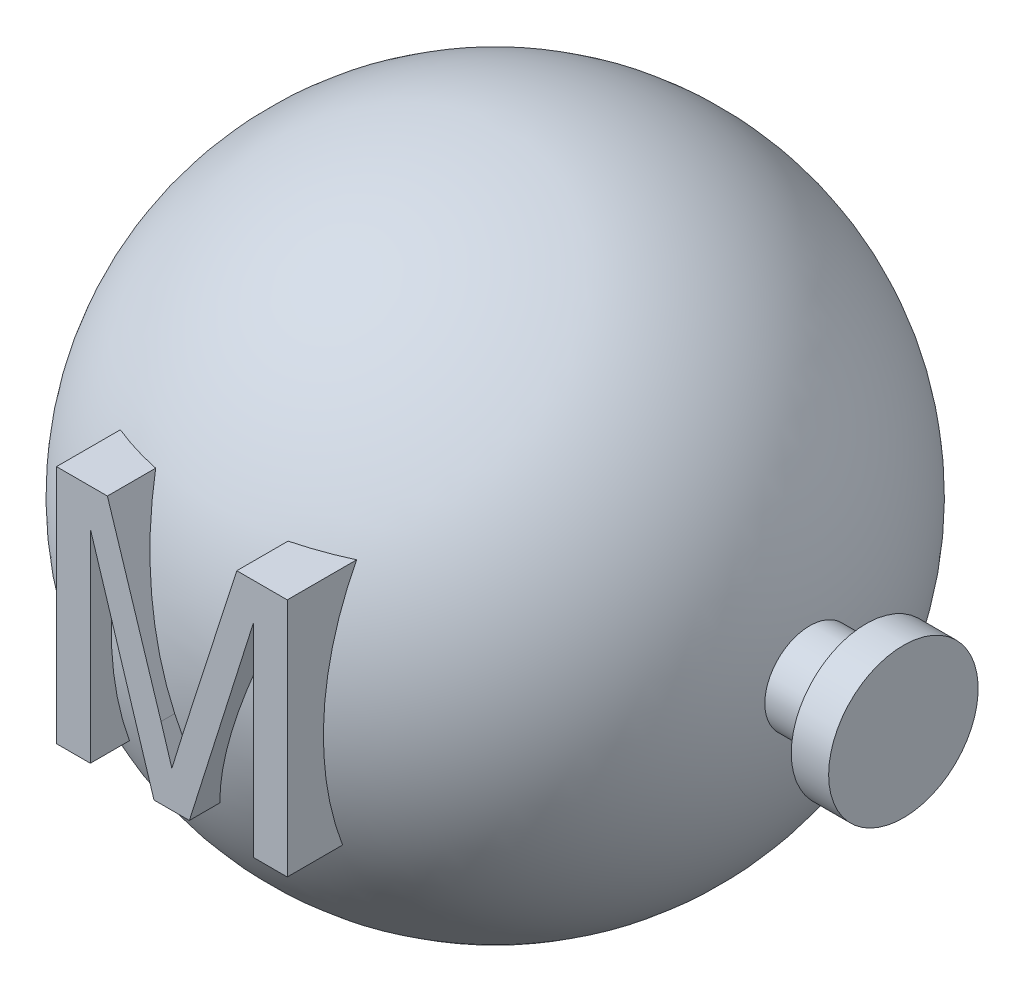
from build123d import *

# Parameters (mm, degrees)
EXTRUSION1_DEPTH = 88.186587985


with BuildPart() as part:
    # Esquisse1 → R_volution1 (revolve)
    with BuildSketch(Plane.XY):
        with BuildLine():
            Line((0, -85), (0, 85))
            ThreePointArc((0, 85), (-85, 0), (0, -85))
        make_face()
    revolve(axis=Axis((0, -85, 0), (0, 1, 0)))

    # Esquisse2 → R_volution2 (revolve)
    with BuildSketch(Plane.XY, mode=Mode.PRIVATE) as r_volution2_sk:
        Polygon((0, 12), (99.213572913, 12), (99.213572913, 20), (109.213572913, 20), (109.213572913, 0), (0, 0), align=None)
    revolve(r_volution2_sk.sketch.rotate(Axis((0, 0, 0), (1, 0, 0)), 90), axis=Axis((0, 0, 0), (1, 0, 0)))

    # Esquisse3 → Extrusion1 (add)
    with BuildSketch(Plane.XY):
        with BuildLine():
            Line((-29.180635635, -27.908653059), (-29.180635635, 36.299314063))
            Line((-29.180635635, 36.299314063), (-15.559594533, 36.299314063))
            Line((-15.559594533, 36.299314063), (-1.205409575, -8.756877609))
            add(Edge.make_bspline(
                [(-1.205409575, -8.756877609), (-1.047441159, -9.26728574), (-0.741939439, -10.254385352), (-0.288916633, -11.679848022), (0.123258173, -13.004496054), (0.49448649, -14.232545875), (0.844819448, -15.357900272), (1.148152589, -16.389793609), (1.438148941, -17.316759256), (1.608099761, -17.905876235), (1.688579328, -18.184850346)],
                knots=[0, 0, 0, 0, 1.300204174, 2.514519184, 3.639827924, 4.676153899, 5.636536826, 6.507959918, 7.293450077, 8, 8, 8, 8], degree=3))
            add(Edge.make_bspline(
                [(1.688579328, -18.184850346), (1.778214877, -17.880325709), (1.968965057, -17.232277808), (2.278201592, -16.213333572), (2.607238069, -15.085757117), (3.000993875, -13.868929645), (3.411437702, -12.54376295), (3.842251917, -11.111357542), (4.339187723, -9.586014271), (4.669426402, -8.52999568), (4.839811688, -7.985147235)],
                knots=[0, 0, 0, 0, 0.713638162, 1.518667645, 2.393860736, 3.354087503, 4.393659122, 5.512594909, 6.716633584, 8, 8, 8, 8], degree=3))
            Line((4.839811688, -7.985147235), (19.052512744, 36.299314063))
            Line((19.052512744, 36.299314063), (32.55779429, 36.299314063))
            Line((32.55779429, 36.299314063), (32.55779429, -27.908653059))
            Line((32.55779429, -27.908653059), (23.502824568, -27.908653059))
            Line((23.502824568, -27.908653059), (23.502824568, 26.421165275))
            Line((23.502824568, 26.421165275), (6.370410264, -27.908653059))
            Line((6.370410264, -27.908653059), (-3.096148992, -27.908653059))
            Line((-3.096148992, -27.908653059), (-20.125665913, 26.421165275))
            Line((-20.125665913, 26.421165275), (-20.125665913, -27.908653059))
            Line((-20.125665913, -27.908653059), (-29.180635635, -27.908653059))
        make_face()
    extrude(amount=EXTRUSION1_DEPTH)


solid = part.part
